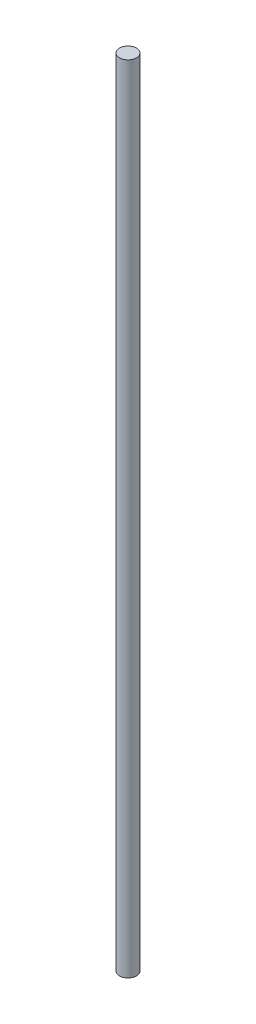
from build123d import *

# Parameters (mm, degrees)
SKETCH1_R           = 4
BOSS_EXTRUDE1_DEPTH = 375


with BuildPart() as part:
    # Sketch1 → Boss-Extrude1 (new body)
    with BuildSketch(Plane(origin=(0, 0, 0), x_dir=(1, 0, 0), z_dir=(0, 1, 0))):
        with Locations(Location((-18.560010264, 5.700078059, 0), (0, 0, 270))):
            Circle(SKETCH1_R)
    extrude(amount=BOSS_EXTRUDE1_DEPTH)


solid = part.part
